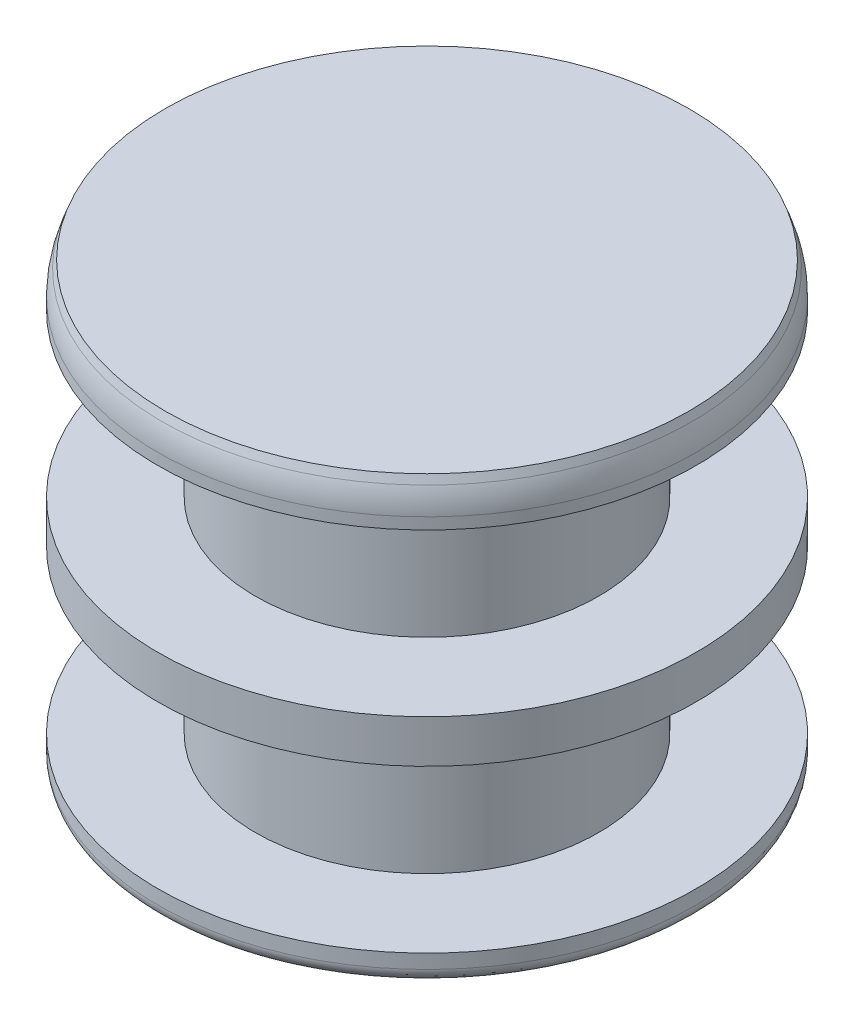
from build123d import *

# Parameters (mm, degrees)
FILLET1_R = 0.2
FILLET2_R = 1


with BuildPart() as part:
    # Sketch1 → Revolve1 (revolve)
    with BuildSketch(Plane.XY, mode=Mode.PRIVATE) as revolve1_sk:
        Polygon((0, 0), (0, -7.99956969), (0.5, -7.99956969), (3.76, -6.040764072), (3.76, -5.73), (2.4, -5.73), (2.4, -3.47), (3.76, -3.47), (3.76, -2.87), (2.4, -2.87), (2.4, -0.61), (3.76, -0.61), (3.76, -0.274747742), (3.66, 0), align=None)
    revolve(revolve1_sk.sketch.rotate(Axis((0, 0, 0), (0, -1, 0)), 180), axis=Axis((0, 0, 0), (0, -1, 0)))

    # Fillet1
    fillet1_edges = [part.edges().sort_by_distance(p)[0] for p in [
        (3.76, -6.040764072, 0),
    ]]
    fillet(fillet1_edges, radius=FILLET1_R)

    # Fillet2
    fillet2_edges = [part.edges().sort_by_distance(p)[0] for p in [
        (3.76, -0.274747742, 0),
    ]]
    fillet(fillet2_edges, radius=FILLET2_R)


solid = part.part
